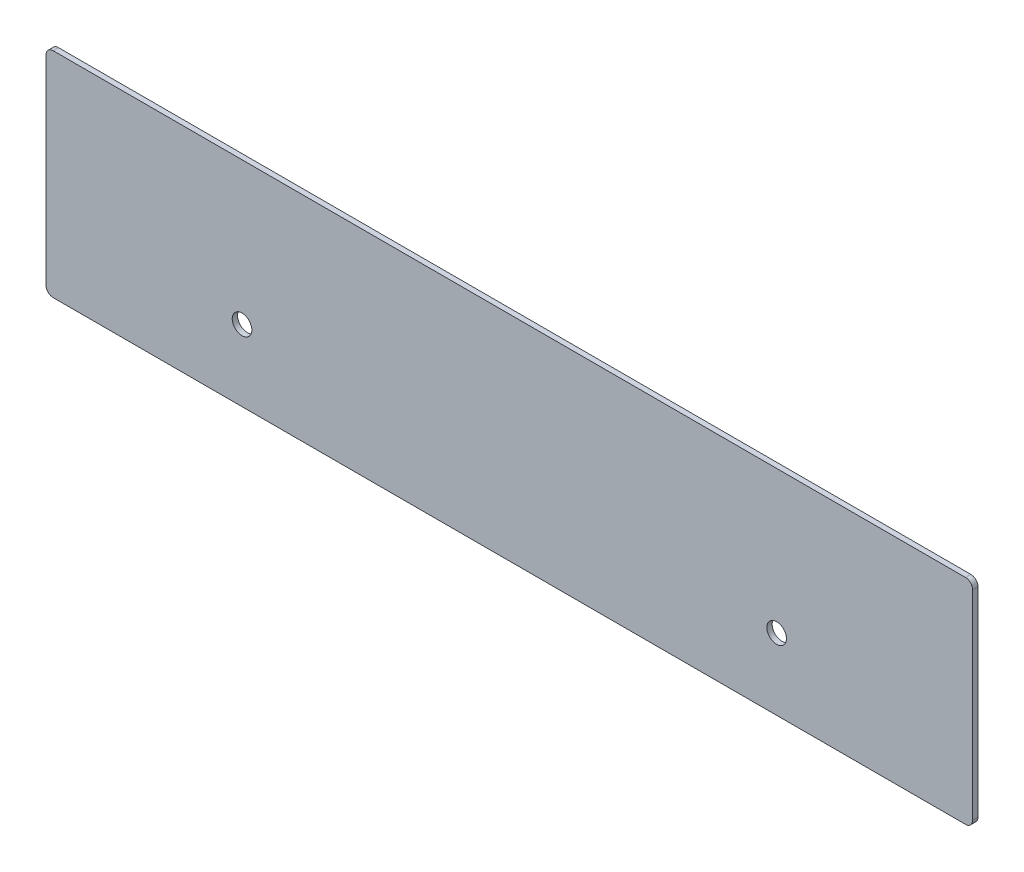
from build123d import *

# Parameters (mm, degrees)
SKIZZE1_W                       = 260
SKIZZE1_H                       = 60
AUFSATZ_LINEAR_AUSTRAGEN1_DEPTH = 1.5
SKIZZE2_R                       = 2.75
SCHNITT_LINEAR_AUSTRAGEN1_DEPTH = 134.425072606
VERRUNDUNG1_R                   = 2


with BuildPart() as part:
    # Skizze1 → Aufsatz-Linear austragen1 (new body)
    with BuildSketch(Plane.XY):
        Rectangle(SKIZZE1_W, SKIZZE1_H)
    extrude(amount=AUFSATZ_LINEAR_AUSTRAGEN1_DEPTH)

    # Skizze2 → Schnitt-Linear austragen1 (cut, through all)
    with BuildSketch(Plane.XY.offset(1.5)):
        with Locations((-75, -10)):
            Circle(SKIZZE2_R)
        with Locations((75, -10)):
            Circle(SKIZZE2_R)
    extrude(amount=-SCHNITT_LINEAR_AUSTRAGEN1_DEPTH, mode=Mode.SUBTRACT)

    # Verrundung1
    verrundung1_edges = [part.edges().sort_by_distance(p)[0] for p in [
        (130, -30, 0.75),
        (-130, -30, 0.75),
        (-130, 30, 0.75),
        (130, 30, 0.75),
    ]]
    fillet(verrundung1_edges, radius=VERRUNDUNG1_R)


solid = part.part
